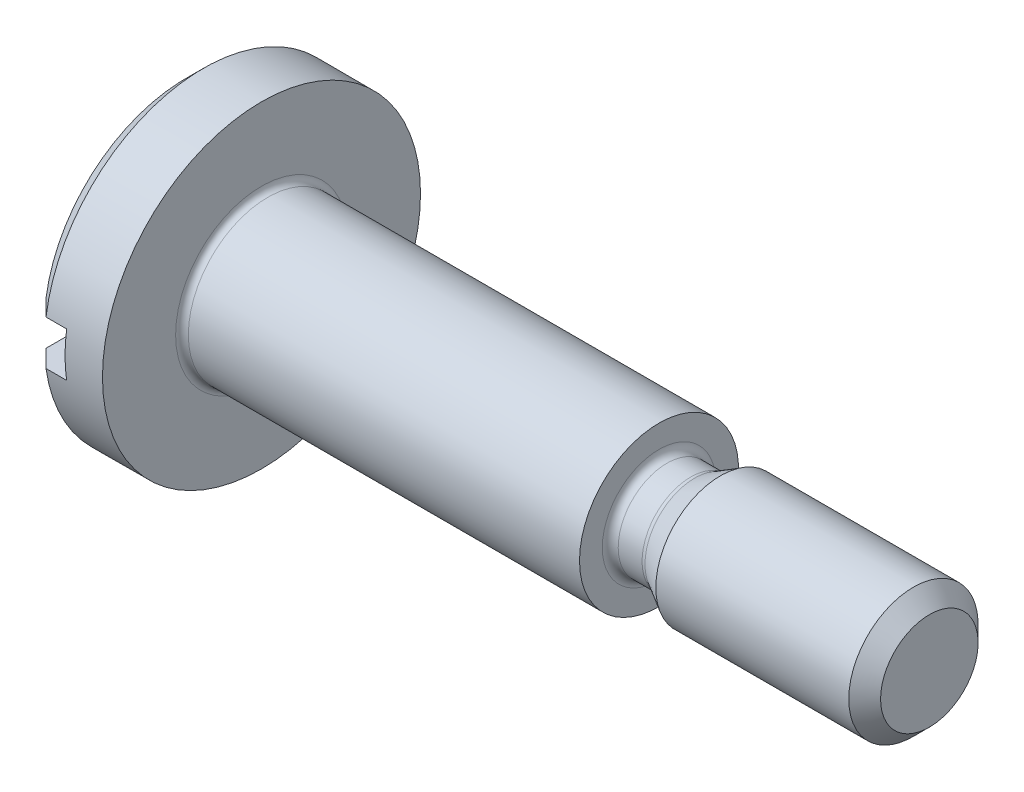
ISO-10303-21;
HEADER;
FILE_DESCRIPTION(('STEP AP214'),'2;1');
FILE_NAME('part.step','',(''),(''),'','','');
FILE_SCHEMA(('AUTOMOTIVE_DESIGN { 1 0 10303 214 1 1 1 1 }'));
ENDSEC;
DATA;
#1=APPLICATION_CONTEXT('core data for automotive mechanical design processes');
#2=APPLICATION_PROTOCOL_DEFINITION('international standard','automotive_design',2000,#1);
#3=PRODUCT_CONTEXT('',#1,'mechanical');
#4=PRODUCT('Part','Part','',(#3));
#5=PRODUCT_RELATED_PRODUCT_CATEGORY('part','',(#4));
#6=PRODUCT_DEFINITION_FORMATION('','',#4);
#7=PRODUCT_DEFINITION_CONTEXT('part definition',#1,'design');
#8=PRODUCT_DEFINITION('design','',#6,#7);
#9=PRODUCT_DEFINITION_SHAPE('','',#8);
#10=(LENGTH_UNIT() NAMED_UNIT(*) SI_UNIT(.MILLI.,.METRE.));
#11=(NAMED_UNIT(*) PLANE_ANGLE_UNIT() SI_UNIT($,.RADIAN.));
#12=(NAMED_UNIT(*) SI_UNIT($,.STERADIAN.) SOLID_ANGLE_UNIT());
#13=UNCERTAINTY_MEASURE_WITH_UNIT(LENGTH_MEASURE(1.E-05),#10,'distance_accuracy_value','');
#14=(GEOMETRIC_REPRESENTATION_CONTEXT(3) GLOBAL_UNCERTAINTY_ASSIGNED_CONTEXT((#13)) GLOBAL_UNIT_ASSIGNED_CONTEXT((#10,
#11,#12)) REPRESENTATION_CONTEXT('',''));
#15=CARTESIAN_POINT('',(0.,0.,0.));
#16=DIRECTION('',(0.,0.,1.));
#17=DIRECTION('',(1.,0.,0.));
#18=AXIS2_PLACEMENT_3D('',#15,#16,#17);
#19=CARTESIAN_POINT('',(0.,0.,0.));
#20=DIRECTION('',(-1.,0.,0.));
#21=DIRECTION('',(0.,0.,1.));
#22=AXIS2_PLACEMENT_3D('',#19,#20,#21);
#23=PLANE('',#22);
#24=DIRECTION('',(0.,0.,-1.));
#25=VECTOR('',#24,1.);
#26=CARTESIAN_POINT('',(0.,1.4,10.));
#27=LINE('',#26,#25);
#28=CARTESIAN_POINT('',(0.,1.4,8.78919791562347));
#29=VERTEX_POINT('',#28);
#30=CARTESIAN_POINT('',(0.,1.4,-8.78919791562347));
#31=VERTEX_POINT('',#30);
#32=EDGE_CURVE('E201',#29,#31,#27,.T.);
#33=ORIENTED_EDGE('',*,*,#32,.F.);
#34=CARTESIAN_POINT('',(0.,0.,0.));
#35=DIRECTION('',(-1.,0.,0.));
#36=DIRECTION('',(0.,0.,1.));
#37=AXIS2_PLACEMENT_3D('',#34,#35,#36);
#38=CIRCLE('',#37,8.9);
#39=EDGE_CURVE('E131',#29,#31,#38,.T.);
#40=ORIENTED_EDGE('',*,*,#39,.T.);
#41=EDGE_LOOP('',(#33,#40));
#42=FACE_BOUND('',#41,.T.);
#43=ADVANCED_FACE('F33',(#42),#23,.T.);
#44=CARTESIAN_POINT('',(1.1,0.,0.));
#45=DIRECTION('',(1.,0.,0.));
#46=DIRECTION('',(0.,0.,-1.));
#47=AXIS2_PLACEMENT_3D('',#44,#45,#46);
#48=CONICAL_SURFACE('',#47,10.,0.785398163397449);
#49=CARTESIAN_POINT('',(1.1,0.,0.));
#50=DIRECTION('',(-1.,0.,0.));
#51=DIRECTION('',(0.,0.,1.));
#52=AXIS2_PLACEMENT_3D('',#49,#50,#51);
#53=CIRCLE('',#52,10.);
#54=CARTESIAN_POINT('',(1.1,1.4,9.90151503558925));
#55=VERTEX_POINT('',#54);
#56=CARTESIAN_POINT('',(1.1,1.4,-9.90151503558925));
#57=VERTEX_POINT('',#56);
#58=EDGE_CURVE('E105',#55,#57,#53,.T.);
#59=ORIENTED_EDGE('',*,*,#58,.T.);
#60=CARTESIAN_POINT('',(13.1183362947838,1.4,-21.9737828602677));
#61=CARTESIAN_POINT('',(12.3669059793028,1.4,-21.2208171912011));
#62=CARTESIAN_POINT('',(11.615542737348,1.4,-20.4677845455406));
#63=CARTESIAN_POINT('',(10.1130222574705,1.4,-18.9614869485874));
#64=CARTESIAN_POINT('',(9.36186502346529,1.4,-18.2082219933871));
#65=CARTESIAN_POINT('',(7.85955437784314,1.4,-16.7010864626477));
#66=CARTESIAN_POINT('',(7.10840108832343,1.4,-15.9472157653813));
#67=CARTESIAN_POINT('',(5.60657238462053,1.4,-14.4390246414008));
#68=CARTESIAN_POINT('',(4.85589696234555,1.4,-13.6847042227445));
#69=CARTESIAN_POINT('',(3.33999593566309,1.4,-12.1599559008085));
#70=CARTESIAN_POINT('',(2.57478547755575,1.4,-11.389512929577));
#71=CARTESIAN_POINT('',(1.42799608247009,1.4,-10.2327894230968));
#72=CARTESIAN_POINT('',(1.04589366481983,1.4,-9.84702795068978));
#73=CARTESIAN_POINT('',(0.282190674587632,1.4,-9.07501238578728));
#74=CARTESIAN_POINT('',(-0.0994099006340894,1.4,-8.6887582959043));
#75=CARTESIAN_POINT('',(-0.861781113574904,1.4,-7.91562329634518));
#76=CARTESIAN_POINT('',(-1.24255193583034,1.4,-7.52874256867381));
#77=CARTESIAN_POINT('',(-2.0029710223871,1.4,-6.75386230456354));
#78=CARTESIAN_POINT('',(-2.38261926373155,1.4,-6.36586274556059));
#79=CARTESIAN_POINT('',(-2.95062619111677,1.4,-5.78247134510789));
#80=CARTESIAN_POINT('',(-3.13970884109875,1.4,-5.58778461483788));
#81=CARTESIAN_POINT('',(-3.51721231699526,1.4,-5.19777082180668));
#82=CARTESIAN_POINT('',(-3.70563314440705,1.4,-5.00244376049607));
#83=CARTESIAN_POINT('',(-4.08154641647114,1.4,-4.61091013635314));
#84=CARTESIAN_POINT('',(-4.26903889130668,1.4,-4.41470360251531));
#85=CARTESIAN_POINT('',(-4.64268522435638,1.4,-4.02102091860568));
#86=CARTESIAN_POINT('',(-4.82883909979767,1.4,-3.82354478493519));
#87=CARTESIAN_POINT('',(-5.06399679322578,1.4,-3.57145430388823));
#88=CARTESIAN_POINT('',(-5.1139632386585,1.4,-3.5177378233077));
#89=CARTESIAN_POINT('',(-5.21372029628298,1.4,-3.41014160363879));
#90=CARTESIAN_POINT('',(-5.2635109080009,1.4,-3.35626186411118));
#91=CARTESIAN_POINT('',(-5.41258534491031,1.4,-3.19434530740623));
#92=CARTESIAN_POINT('',(-5.51157032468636,1.4,-3.08603270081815));
#93=CARTESIAN_POINT('',(-5.70833720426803,1.4,-2.86859717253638));
#94=CARTESIAN_POINT('',(-5.80612060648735,1.4,-2.75947561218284));
#95=CARTESIAN_POINT('',(-6.00022872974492,1.4,-2.53994400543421));
#96=CARTESIAN_POINT('',(-6.09655349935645,1.4,-2.42953400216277));
#97=CARTESIAN_POINT('',(-6.25772763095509,1.4,-2.24124497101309));
#98=CARTESIAN_POINT('',(-6.32312294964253,1.4,-2.16383398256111));
#99=CARTESIAN_POINT('',(-6.45258851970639,1.4,-2.00791328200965));
#100=CARTESIAN_POINT('',(-6.51665882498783,1.4,-1.92940361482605));
#101=CARTESIAN_POINT('',(-6.64318992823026,1.4,-1.77073200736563));
#102=CARTESIAN_POINT('',(-6.70564571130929,1.4,-1.69056605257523));
#103=CARTESIAN_POINT('',(-6.82804619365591,1.4,-1.52834444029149));
#104=CARTESIAN_POINT('',(-6.88799131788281,1.4,-1.44628910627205));
#105=CARTESIAN_POINT('',(-6.99219748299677,1.4,-1.29689813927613));
#106=CARTESIAN_POINT('',(-7.03713410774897,1.4,-1.23003664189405));
#107=CARTESIAN_POINT('',(-7.12387095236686,1.4,-1.09424479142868));
#108=CARTESIAN_POINT('',(-7.16566966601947,1.4,-1.02531346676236));
#109=CARTESIAN_POINT('',(-7.24466911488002,1.4,-0.885132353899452));
#110=CARTESIAN_POINT('',(-7.28188516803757,1.4,-0.81389135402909));
#111=CARTESIAN_POINT('',(-7.34992716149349,1.4,-0.66847604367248));
#112=CARTESIAN_POINT('',(-7.38076069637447,1.4,-0.594305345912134));
#113=CARTESIAN_POINT('',(-7.4360682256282,1.4,-0.434942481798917));
#114=CARTESIAN_POINT('',(-7.45958136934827,1.4,-0.349395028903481));
#115=CARTESIAN_POINT('',(-7.48359397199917,1.4,-0.219161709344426));
#116=CARTESIAN_POINT('',(-7.48972123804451,1.4,-0.175494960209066));
#117=CARTESIAN_POINT('',(-7.49792914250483,1.4,-0.0877736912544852));
#118=CARTESIAN_POINT('',(-7.50001007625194,1.4,-0.0437191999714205));
#119=CARTESIAN_POINT('',(-7.49998980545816,1.4,0.044555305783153));
#120=CARTESIAN_POINT('',(-7.4978726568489,1.4,0.0887753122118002));
#121=CARTESIAN_POINT('',(-7.48955832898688,1.4,0.176826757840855));
#122=CARTESIAN_POINT('',(-7.48336082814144,1.4,0.220658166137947));
#123=CARTESIAN_POINT('',(-7.46721522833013,1.4,0.307751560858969));
#124=CARTESIAN_POINT('',(-7.45725583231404,1.4,0.351011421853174));
#125=CARTESIAN_POINT('',(-7.43406971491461,1.4,0.436635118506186));
#126=CARTESIAN_POINT('',(-7.42084273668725,1.4,0.478998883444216));
#127=CARTESIAN_POINT('',(-7.37441083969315,1.4,0.612176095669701));
#128=CARTESIAN_POINT('',(-7.33604567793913,1.4,0.701188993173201));
#129=CARTESIAN_POINT('',(-7.250778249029,1.4,0.875040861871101));
#130=CARTESIAN_POINT('',(-7.20385901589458,1.4,0.959871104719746));
#131=CARTESIAN_POINT('',(-7.10409140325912,1.4,1.12685129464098));
#132=CARTESIAN_POINT('',(-7.05119863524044,1.4,1.20897440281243));
#133=CARTESIAN_POINT('',(-6.96906786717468,1.4,1.33017698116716));
#134=CARTESIAN_POINT('',(-6.94123866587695,1.4,1.37023012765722));
#135=CARTESIAN_POINT('',(-6.88479169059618,1.4,1.44977602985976));
#136=CARTESIAN_POINT('',(-6.85617394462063,1.4,1.48926880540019));
#137=CARTESIAN_POINT('',(-6.76355741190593,1.4,1.61486926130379));
#138=CARTESIAN_POINT('',(-6.69830597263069,1.4,1.70005240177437));
#139=CARTESIAN_POINT('',(-6.56561520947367,1.4,1.86870242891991));
#140=CARTESIAN_POINT('',(-6.4981755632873,1.4,1.95216905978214));
#141=CARTESIAN_POINT('',(-6.36168848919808,1.4,2.11783624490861));
#142=CARTESIAN_POINT('',(-6.2926403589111,1.4,2.20003621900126));
#143=CARTESIAN_POINT('',(-6.15336552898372,1.4,2.36343317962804));
#144=CARTESIAN_POINT('',(-6.08313878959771,1.4,2.44463013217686));
#145=CARTESIAN_POINT('',(-5.87089373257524,1.4,2.68732215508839));
#146=CARTESIAN_POINT('',(-5.72753813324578,1.4,2.8476463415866));
#147=CARTESIAN_POINT('',(-5.43868072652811,1.4,3.16625856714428));
#148=CARTESIAN_POINT('',(-5.29317950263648,1.4,3.3245471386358));
#149=CARTESIAN_POINT('',(-5.00125032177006,1.4,3.63918632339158));
#150=CARTESIAN_POINT('',(-4.85482772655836,1.4,3.79554191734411));
#151=CARTESIAN_POINT('',(-4.56095961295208,1.4,4.10730705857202));
#152=CARTESIAN_POINT('',(-4.41351402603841,1.4,4.26271654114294));
#153=CARTESIAN_POINT('',(-4.11803370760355,1.4,4.57267860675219));
#154=CARTESIAN_POINT('',(-3.96999970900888,1.4,4.72723188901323));
#155=CARTESIAN_POINT('',(-3.67338319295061,1.4,5.03580405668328));
#156=CARTESIAN_POINT('',(-3.52480068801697,1.4,5.18982295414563));
#157=CARTESIAN_POINT('',(-3.07952815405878,1.4,5.65013099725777));
#158=CARTESIAN_POINT('',(-2.78221594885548,1.4,5.95581810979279));
#159=CARTESIAN_POINT('',(-2.18655444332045,1.4,6.56618066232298));
#160=CARTESIAN_POINT('',(-1.88820513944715,1.4,6.87085609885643));
#161=CARTESIAN_POINT('',(-1.29080174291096,1.4,7.47952507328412));
#162=CARTESIAN_POINT('',(-0.991747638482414,1.4,7.78351859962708));
#163=CARTESIAN_POINT('',(-0.393146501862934,1.4,8.39102004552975));
#164=CARTESIAN_POINT('',(-0.0935994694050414,1.4,8.69452796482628));
#165=CARTESIAN_POINT('',(0.80580526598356,1.4,9.60476284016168));
#166=CARTESIAN_POINT('',(1.40619429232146,1.4,10.2109647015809));
#167=CARTESIAN_POINT('',(2.60777785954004,1.4,11.4225597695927));
#168=CARTESIAN_POINT('',(3.20897239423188,1.4,12.0279529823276));
#169=CARTESIAN_POINT('',(4.41204591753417,1.4,13.2383916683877));
#170=CARTESIAN_POINT('',(5.01392504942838,1.4,13.8434369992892));
#171=CARTESIAN_POINT('',(6.21803298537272,1.4,15.0531819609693));
#172=CARTESIAN_POINT('',(6.82026179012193,1.4,15.657881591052));
#173=CARTESIAN_POINT('',(8.62719765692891,1.4,17.4715069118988));
#174=CARTESIAN_POINT('',(9.83226659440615,1.4,18.6800720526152));
#175=CARTESIAN_POINT('',(11.2109766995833,1.4,20.0621913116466));
#176=CARTESIAN_POINT('',(11.3843650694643,1.4,20.2359977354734));
#177=CARTESIAN_POINT('',(11.7311541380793,1.4,20.5836018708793));
#178=CARTESIAN_POINT('',(11.9045548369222,1.4,20.7573995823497));
#179=CARTESIAN_POINT('',(12.2513480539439,1.4,21.1049676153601));
#180=CARTESIAN_POINT('',(12.4247405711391,1.4,21.2787379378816));
#181=CARTESIAN_POINT('',(12.7715327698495,1.4,21.6262678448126));
#182=CARTESIAN_POINT('',(12.944932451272,1.4,21.8000274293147));
#183=CARTESIAN_POINT('',(13.1183362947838,1.4,21.9737828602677));
#184=B_SPLINE_CURVE_WITH_KNOTS('',3,(#60,#61,#62,#63,#64,#65,#66,#67,#68,#69,#70,#71,#72,#73,
#74,#75,#76,#77,#78,#79,#80,#81,#82,#83,#84,#85,#86,#87,#88,#89,#90,#91,#92,#93,#94,#95,#96,#97,
#98,#99,#100,#101,#102,#103,#104,#105,#106,#107,#108,#109,#110,#111,#112,#113,#114,#115,#116,
#117,#118,#119,#120,#121,#122,#123,#124,#125,#126,#127,#128,#129,#130,#131,#132,#133,#134,#135,
#136,#137,#138,#139,#140,#141,#142,#143,#144,#145,#146,#147,#148,#149,#150,#151,#152,#153,#154,
#155,#156,#157,#158,#159,#160,#161,#162,#163,#164,#165,#166,#167,#168,#169,#170,#171,#172,#173,
#174,#175,#176,#177,#178,#179,#180,#181,#182,#183),.UNSPECIFIED.,.F.,.F.,(4,2,2,2,2,2,2,2,2,2,2,
2,2,2,2,2,2,2,2,2,2,2,2,2,2,2,2,2,2,2,2,2,2,2,2,2,2,2,2,2,2,2,2,2,2,2,2,2,2,2,2,2,2,2,2,2,2,2,2,
2,2,4),(0.,3.19130750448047,6.38267198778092,9.57531503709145,12.767902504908,16.0255330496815,
17.6544365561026,19.2833314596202,20.9118168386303,22.5403352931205,23.3545188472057,
24.1687005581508,24.9828556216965,25.7970001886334,26.0170883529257,26.2371771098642,
26.6773609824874,27.1169228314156,27.5564700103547,27.8604678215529,28.1644532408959,
28.4692907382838,28.7740764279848,29.0156904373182,29.257419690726,29.4983176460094,
29.738927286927,30.0039149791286,30.1360359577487,30.2681472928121,30.4007613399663,
30.5333858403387,30.6664118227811,30.7994482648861,31.0894260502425,31.3799853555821,
31.672866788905,31.8191774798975,31.9654829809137,32.2873332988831,32.6092312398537,
32.9312724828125,33.2533246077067,33.8984925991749,34.5434882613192,35.1861164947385,
35.8287881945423,36.4708198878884,37.1128370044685,38.3921103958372,39.6713881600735,
40.9506874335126,42.2299874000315,44.7895812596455,47.3491555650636,49.9094375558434,
52.4697246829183,57.5898207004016,58.3263326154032,59.0628521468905,59.7992961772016,
60.5357325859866),.UNSPECIFIED.);
#185=EDGE_CURVE('E47',#57,#31,#184,.T.);
#186=ORIENTED_EDGE('',*,*,#185,.T.);
#187=ORIENTED_EDGE('',*,*,#39,.F.);
#188=EDGE_CURVE('E209',#29,#55,#184,.T.);
#189=ORIENTED_EDGE('',*,*,#188,.T.);
#190=EDGE_LOOP('',(#59,#186,#187,#189));
#191=FACE_BOUND('',#190,.T.);
#192=ADVANCED_FACE('F183',(#191),#48,.T.);
#193=CARTESIAN_POINT('',(-25.4,0.,0.));
#194=DIRECTION('',(-1.,0.,0.));
#195=DIRECTION('',(0.,0.,1.));
#196=AXIS2_PLACEMENT_3D('',#193,#194,#195);
#197=CYLINDRICAL_SURFACE('',#196,5.);
#198=CARTESIAN_POINT('',(5.15,0.,0.));
#199=DIRECTION('',(-1.,0.,0.));
#200=DIRECTION('',(0.,0.,1.));
#201=AXIS2_PLACEMENT_3D('',#198,#199,#200);
#202=CIRCLE('',#201,5.);
#203=CARTESIAN_POINT('',(5.15,0.,5.));
#204=VERTEX_POINT('',#203);
#205=EDGE_CURVE('E95',#204,#204,#202,.F.);
#206=ORIENTED_EDGE('',*,*,#205,.T.);
#207=EDGE_LOOP('',(#206));
#208=FACE_BOUND('',#207,.T.);
#209=CARTESIAN_POINT('',(29.75,0.,0.));
#210=DIRECTION('',(-1.,0.,0.));
#211=DIRECTION('',(0.,0.,1.));
#212=AXIS2_PLACEMENT_3D('',#209,#210,#211);
#213=CIRCLE('',#212,5.);
#214=CARTESIAN_POINT('',(29.75,0.,5.));
#215=VERTEX_POINT('',#214);
#216=EDGE_CURVE('E155',#215,#215,#213,.T.);
#217=ORIENTED_EDGE('',*,*,#216,.T.);
#218=EDGE_LOOP('',(#217));
#219=FACE_BOUND('',#218,.T.);
#220=ADVANCED_FACE('F164',(#208,#219),#197,.T.);
#221=CARTESIAN_POINT('',(29.75,5.,0.));
#222=DIRECTION('',(1.,0.,0.));
#223=DIRECTION('',(0.,0.,-1.));
#224=AXIS2_PLACEMENT_3D('',#221,#222,#223);
#225=PLANE('',#224);
#226=CARTESIAN_POINT('',(29.75,0.,0.));
#227=DIRECTION('',(-1.,0.,0.));
#228=DIRECTION('',(0.,0.,1.));
#229=AXIS2_PLACEMENT_3D('',#226,#227,#228);
#230=CIRCLE('',#229,3.56626694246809);
#231=CARTESIAN_POINT('',(29.75,0.,3.56626694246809));
#232=VERTEX_POINT('',#231);
#233=EDGE_CURVE('E152',#232,#232,#230,.T.);
#234=ORIENTED_EDGE('',*,*,#233,.T.);
#235=EDGE_LOOP('',(#234));
#236=FACE_BOUND('',#235,.T.);
#237=ORIENTED_EDGE('',*,*,#216,.F.);
#238=EDGE_LOOP('',(#237));
#239=FACE_BOUND('',#238,.T.);
#240=ADVANCED_FACE('F329',(#236,#239),#225,.T.);
#241=CARTESIAN_POINT('',(30.25,0.,0.));
#242=DIRECTION('',(-1.,0.,0.));
#243=DIRECTION('',(0.,0.,1.));
#244=AXIS2_PLACEMENT_3D('',#241,#242,#243);
#245=TOROIDAL_SURFACE('',#244,3.56626694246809,0.5);
#246=ORIENTED_EDGE('',*,*,#233,.F.);
#247=EDGE_LOOP('',(#246));
#248=FACE_BOUND('',#247,.T.);
#249=CARTESIAN_POINT('',(30.25,0.,0.));
#250=DIRECTION('',(-1.,0.,0.));
#251=DIRECTION('',(0.,0.,1.));
#252=AXIS2_PLACEMENT_3D('',#249,#250,#251);
#253=CIRCLE('',#252,3.06626694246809);
#254=CARTESIAN_POINT('',(30.25,0.,3.06626694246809));
#255=VERTEX_POINT('',#254);
#256=EDGE_CURVE('E149',#255,#255,#253,.T.);
#257=ORIENTED_EDGE('',*,*,#256,.T.);
#258=EDGE_LOOP('',(#257));
#259=FACE_BOUND('',#258,.T.);
#260=ADVANCED_FACE('F320',(#248,#259),#245,.F.);
#261=CARTESIAN_POINT('',(-25.4,0.,0.));
#262=DIRECTION('',(-1.,0.,0.));
#263=DIRECTION('',(0.,0.,1.));
#264=AXIS2_PLACEMENT_3D('',#261,#262,#263);
#265=CYLINDRICAL_SURFACE('',#264,3.06626694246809);
#266=CARTESIAN_POINT('',(31.75,0.,0.));
#267=DIRECTION('',(-1.,0.,0.));
#268=DIRECTION('',(0.,0.,1.));
#269=AXIS2_PLACEMENT_3D('',#266,#267,#268);
#270=CIRCLE('',#269,3.06626694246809);
#271=CARTESIAN_POINT('',(31.75,0.,3.06626694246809));
#272=VERTEX_POINT('',#271);
#273=EDGE_CURVE('E146',#272,#272,#270,.T.);
#274=ORIENTED_EDGE('',*,*,#273,.T.);
#275=EDGE_LOOP('',(#274));
#276=FACE_BOUND('',#275,.T.);
#277=ORIENTED_EDGE('',*,*,#256,.F.);
#278=EDGE_LOOP('',(#277));
#279=FACE_BOUND('',#278,.T.);
#280=ADVANCED_FACE('F311',(#276,#279),#265,.T.);
#281=CARTESIAN_POINT('',(31.75,0.,0.));
#282=DIRECTION('',(-1.,0.,0.));
#283=DIRECTION('',(0.,0.,1.));
#284=AXIS2_PLACEMENT_3D('',#281,#282,#283);
#285=TOROIDAL_SURFACE('',#284,3.56626694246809,0.500000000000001);
#286=ORIENTED_EDGE('',*,*,#273,.F.);
#287=EDGE_LOOP('',(#286));
#288=FACE_BOUND('',#287,.T.);
#289=CARTESIAN_POINT('',(32.,0.,0.));
#290=DIRECTION('',(-1.,0.,0.));
#291=DIRECTION('',(0.,0.,1.));
#292=AXIS2_PLACEMENT_3D('',#289,#290,#291);
#293=CIRCLE('',#292,3.13325424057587);
#294=CARTESIAN_POINT('',(32.,0.,3.13325424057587));
#295=VERTEX_POINT('',#294);
#296=EDGE_CURVE('E143',#295,#295,#293,.T.);
#297=ORIENTED_EDGE('',*,*,#296,.T.);
#298=EDGE_LOOP('',(#297));
#299=FACE_BOUND('',#298,.T.);
#300=ADVANCED_FACE('F302',(#288,#299),#285,.F.);
#301=CARTESIAN_POINT('',(32.,0.,0.));
#302=DIRECTION('',(1.,0.,0.));
#303=DIRECTION('',(0.,0.,-1.));
#304=AXIS2_PLACEMENT_3D('',#301,#302,#303);
#305=CONICAL_SURFACE('',#304,3.13325424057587,0.523598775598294);
#306=CARTESIAN_POINT('',(33.6160254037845,0.,0.));
#307=DIRECTION('',(-1.,0.,0.));
#308=DIRECTION('',(0.,0.,1.));
#309=AXIS2_PLACEMENT_3D('',#306,#307,#308);
#310=CIRCLE('',#309,4.06626694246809);
#311=CARTESIAN_POINT('',(33.6160254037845,0.,4.06626694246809));
#312=VERTEX_POINT('',#311);
#313=EDGE_CURVE('E140',#312,#312,#310,.T.);
#314=ORIENTED_EDGE('',*,*,#313,.T.);
#315=EDGE_LOOP('',(#314));
#316=FACE_BOUND('',#315,.T.);
#317=ORIENTED_EDGE('',*,*,#296,.F.);
#318=EDGE_LOOP('',(#317));
#319=FACE_BOUND('',#318,.T.);
#320=ADVANCED_FACE('F293',(#316,#319),#305,.T.);
#321=CARTESIAN_POINT('',(-25.4,0.,0.));
#322=DIRECTION('',(-1.,0.,0.));
#323=DIRECTION('',(0.,0.,1.));
#324=AXIS2_PLACEMENT_3D('',#321,#322,#323);
#325=CYLINDRICAL_SURFACE('',#324,4.06626694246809);
#326=ORIENTED_EDGE('',*,*,#313,.F.);
#327=EDGE_LOOP('',(#326));
#328=FACE_BOUND('',#327,.T.);
#329=CARTESIAN_POINT('',(45.75,0.,0.));
#330=DIRECTION('',(-1.,0.,0.));
#331=DIRECTION('',(0.,0.,1.));
#332=AXIS2_PLACEMENT_3D('',#329,#330,#331);
#333=CIRCLE('',#332,4.06626694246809);
#334=CARTESIAN_POINT('',(45.75,0.,4.06626694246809));
#335=VERTEX_POINT('',#334);
#336=EDGE_CURVE('E137',#335,#335,#333,.T.);
#337=ORIENTED_EDGE('',*,*,#336,.T.);
#338=EDGE_LOOP('',(#337));
#339=FACE_BOUND('',#338,.T.);
#340=ADVANCED_FACE('F284',(#328,#339),#325,.T.);
#341=CARTESIAN_POINT('',(46.75,0.,0.));
#342=DIRECTION('',(-1.,0.,0.));
#343=DIRECTION('',(0.,0.,1.));
#344=AXIS2_PLACEMENT_3D('',#341,#342,#343);
#345=CONICAL_SURFACE('',#344,3.06626694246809,0.785398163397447);
#346=ORIENTED_EDGE('',*,*,#336,.F.);
#347=EDGE_LOOP('',(#346));
#348=FACE_BOUND('',#347,.T.);
#349=CARTESIAN_POINT('',(46.75,0.,0.));
#350=DIRECTION('',(-1.,0.,0.));
#351=DIRECTION('',(0.,0.,1.));
#352=AXIS2_PLACEMENT_3D('',#349,#350,#351);
#353=CIRCLE('',#352,3.06626694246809);
#354=CARTESIAN_POINT('',(46.75,0.,3.06626694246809));
#355=VERTEX_POINT('',#354);
#356=EDGE_CURVE('E134',#355,#355,#353,.T.);
#357=ORIENTED_EDGE('',*,*,#356,.T.);
#358=EDGE_LOOP('',(#357));
#359=FACE_BOUND('',#358,.T.);
#360=ADVANCED_FACE('F199',(#348,#359),#345,.T.);
#361=CARTESIAN_POINT('',(46.75,3.06626694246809,0.));
#362=DIRECTION('',(1.,0.,0.));
#363=DIRECTION('',(0.,0.,-1.));
#364=AXIS2_PLACEMENT_3D('',#361,#362,#363);
#365=PLANE('',#364);
#366=ORIENTED_EDGE('',*,*,#356,.F.);
#367=EDGE_LOOP('',(#366));
#368=FACE_BOUND('',#367,.T.);
#369=ADVANCED_FACE('F194',(#368),#365,.T.);
#370=DIRECTION('',(0.,0.,1.));
#371=VECTOR('',#370,1.);
#372=CARTESIAN_POINT('',(0.,-1.4,-10.));
#373=LINE('',#372,#371);
#374=CARTESIAN_POINT('',(0.,-1.4,-8.78919791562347));
#375=VERTEX_POINT('',#374);
#376=CARTESIAN_POINT('',(0.,-1.4,8.78919791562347));
#377=VERTEX_POINT('',#376);
#378=EDGE_CURVE('E99',#375,#377,#373,.T.);
#379=ORIENTED_EDGE('',*,*,#378,.F.);
#380=EDGE_CURVE('E122',#375,#377,#38,.T.);
#381=ORIENTED_EDGE('',*,*,#380,.T.);
#382=EDGE_LOOP('',(#379,#381));
#383=FACE_BOUND('',#382,.T.);
#384=ADVANCED_FACE('F181',(#383),#23,.T.);
#385=CARTESIAN_POINT('',(1.1,-1.4,-9.90151503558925));
#386=VERTEX_POINT('',#385);
#387=CARTESIAN_POINT('',(1.1,-1.4,9.90151503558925));
#388=VERTEX_POINT('',#387);
#389=EDGE_CURVE('E120',#386,#388,#53,.T.);
#390=ORIENTED_EDGE('',*,*,#389,.T.);
#391=CARTESIAN_POINT('',(13.1183362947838,-1.4,21.9737828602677));
#392=CARTESIAN_POINT('',(12.3669059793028,-1.4,21.2208171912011));
#393=CARTESIAN_POINT('',(11.615542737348,-1.4,20.4677845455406));
#394=CARTESIAN_POINT('',(10.1130222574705,-1.4,18.9614869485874));
#395=CARTESIAN_POINT('',(9.36186502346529,-1.4,18.2082219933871));
#396=CARTESIAN_POINT('',(7.85955437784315,-1.4,16.7010864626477));
#397=CARTESIAN_POINT('',(7.10840108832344,-1.4,15.9472157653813));
#398=CARTESIAN_POINT('',(5.60657238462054,-1.4,14.4390246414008));
#399=CARTESIAN_POINT('',(4.85589696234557,-1.4,13.6847042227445));
#400=CARTESIAN_POINT('',(3.33999593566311,-1.4,12.1599559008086));
#401=CARTESIAN_POINT('',(2.57478547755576,-1.4,11.389512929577));
#402=CARTESIAN_POINT('',(1.42799608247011,-1.4,10.2327894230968));
#403=CARTESIAN_POINT('',(1.04589366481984,-1.4,9.8470279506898));
#404=CARTESIAN_POINT('',(0.28219067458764,-1.4,9.07501238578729));
#405=CARTESIAN_POINT('',(-0.0994099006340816,-1.4,8.68875829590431));
#406=CARTESIAN_POINT('',(-0.861781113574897,-1.4,7.91562329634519));
#407=CARTESIAN_POINT('',(-1.24255193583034,-1.4,7.52874256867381));
#408=CARTESIAN_POINT('',(-2.0029710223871,-1.4,6.75386230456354));
#409=CARTESIAN_POINT('',(-2.38261926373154,-1.4,6.36586274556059));
#410=CARTESIAN_POINT('',(-2.95062619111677,-1.4,5.78247134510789));
#411=CARTESIAN_POINT('',(-3.13970884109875,-1.4,5.58778461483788));
#412=CARTESIAN_POINT('',(-3.51721231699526,-1.4,5.19777082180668));
#413=CARTESIAN_POINT('',(-3.70563314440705,-1.4,5.00244376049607));
#414=CARTESIAN_POINT('',(-4.08154641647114,-1.4,4.61091013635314));
#415=CARTESIAN_POINT('',(-4.26903889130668,-1.4,4.41470360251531));
#416=CARTESIAN_POINT('',(-4.64268522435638,-1.4,4.02102091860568));
#417=CARTESIAN_POINT('',(-4.82883909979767,-1.4,3.82354478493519));
#418=CARTESIAN_POINT('',(-5.06399679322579,-1.4,3.57145430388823));
#419=CARTESIAN_POINT('',(-5.11396323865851,-1.4,3.5177378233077));
#420=CARTESIAN_POINT('',(-5.21372029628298,-1.4,3.41014160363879));
#421=CARTESIAN_POINT('',(-5.2635109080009,-1.4,3.35626186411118));
#422=CARTESIAN_POINT('',(-5.41258534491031,-1.4,3.19434530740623));
#423=CARTESIAN_POINT('',(-5.51157032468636,-1.4,3.08603270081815));
#424=CARTESIAN_POINT('',(-5.70833720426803,-1.4,2.86859717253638));
#425=CARTESIAN_POINT('',(-5.80612060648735,-1.4,2.75947561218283));
#426=CARTESIAN_POINT('',(-6.00022872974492,-1.4,2.53994400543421));
#427=CARTESIAN_POINT('',(-6.09655349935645,-1.4,2.42953400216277));
#428=CARTESIAN_POINT('',(-6.2577276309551,-1.4,2.24124497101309));
#429=CARTESIAN_POINT('',(-6.32312294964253,-1.4,2.16383398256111));
#430=CARTESIAN_POINT('',(-6.45258851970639,-1.4,2.00791328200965));
#431=CARTESIAN_POINT('',(-6.51665882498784,-1.4,1.92940361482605));
#432=CARTESIAN_POINT('',(-6.64318992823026,-1.4,1.77073200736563));
#433=CARTESIAN_POINT('',(-6.70564571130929,-1.4,1.69056605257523));
#434=CARTESIAN_POINT('',(-6.82804619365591,-1.4,1.52834444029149));
#435=CARTESIAN_POINT('',(-6.88799131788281,-1.4,1.44628910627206));
#436=CARTESIAN_POINT('',(-6.99219748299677,-1.4,1.29689813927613));
#437=CARTESIAN_POINT('',(-7.03713410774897,-1.4,1.23003664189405));
#438=CARTESIAN_POINT('',(-7.12387095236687,-1.4,1.09424479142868));
#439=CARTESIAN_POINT('',(-7.16566966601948,-1.4,1.02531346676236));
#440=CARTESIAN_POINT('',(-7.24466911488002,-1.4,0.885132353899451));
#441=CARTESIAN_POINT('',(-7.28188516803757,-1.4,0.813891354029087));
#442=CARTESIAN_POINT('',(-7.34992716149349,-1.4,0.668476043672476));
#443=CARTESIAN_POINT('',(-7.38076069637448,-1.4,0.59430534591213));
#444=CARTESIAN_POINT('',(-7.43606822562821,-1.4,0.434942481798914));
#445=CARTESIAN_POINT('',(-7.45958136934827,-1.4,0.349395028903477));
#446=CARTESIAN_POINT('',(-7.48359397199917,-1.4,0.219161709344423));
#447=CARTESIAN_POINT('',(-7.48972123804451,-1.4,0.175494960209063));
#448=CARTESIAN_POINT('',(-7.49792914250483,-1.4,0.0877736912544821));
#449=CARTESIAN_POINT('',(-7.50001007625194,-1.4,0.0437191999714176));
#450=CARTESIAN_POINT('',(-7.49998980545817,-1.4,-0.0445553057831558));
#451=CARTESIAN_POINT('',(-7.49787265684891,-1.4,-0.088775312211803));
#452=CARTESIAN_POINT('',(-7.48955832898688,-1.4,-0.176826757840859));
#453=CARTESIAN_POINT('',(-7.48336082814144,-1.4,-0.220658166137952));
#454=CARTESIAN_POINT('',(-7.46721522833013,-1.4,-0.307751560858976));
#455=CARTESIAN_POINT('',(-7.45725583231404,-1.4,-0.35101142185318));
#456=CARTESIAN_POINT('',(-7.43406971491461,-1.4,-0.436635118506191));
#457=CARTESIAN_POINT('',(-7.42084273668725,-1.4,-0.478998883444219));
#458=CARTESIAN_POINT('',(-7.37441083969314,-1.4,-0.612176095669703));
#459=CARTESIAN_POINT('',(-7.33604567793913,-1.4,-0.701188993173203));
#460=CARTESIAN_POINT('',(-7.250778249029,-1.4,-0.875040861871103));
#461=CARTESIAN_POINT('',(-7.20385901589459,-1.4,-0.959871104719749));
#462=CARTESIAN_POINT('',(-7.10409140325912,-1.4,-1.12685129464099));
#463=CARTESIAN_POINT('',(-7.05119863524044,-1.4,-1.20897440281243));
#464=CARTESIAN_POINT('',(-6.96906786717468,-1.4,-1.33017698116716));
#465=CARTESIAN_POINT('',(-6.94123866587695,-1.4,-1.37023012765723));
#466=CARTESIAN_POINT('',(-6.88479169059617,-1.4,-1.44977602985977));
#467=CARTESIAN_POINT('',(-6.85617394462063,-1.4,-1.4892688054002));
#468=CARTESIAN_POINT('',(-6.76355741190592,-1.4,-1.6148692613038));
#469=CARTESIAN_POINT('',(-6.69830597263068,-1.4,-1.70005240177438));
#470=CARTESIAN_POINT('',(-6.56561520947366,-1.4,-1.86870242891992));
#471=CARTESIAN_POINT('',(-6.49817556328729,-1.4,-1.95216905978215));
#472=CARTESIAN_POINT('',(-6.36168848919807,-1.4,-2.11783624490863));
#473=CARTESIAN_POINT('',(-6.29264035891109,-1.4,-2.20003621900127));
#474=CARTESIAN_POINT('',(-6.15336552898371,-1.4,-2.36343317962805));
#475=CARTESIAN_POINT('',(-6.0831387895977,-1.4,-2.44463013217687));
#476=CARTESIAN_POINT('',(-5.87089373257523,-1.4,-2.68732215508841));
#477=CARTESIAN_POINT('',(-5.72753813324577,-1.4,-2.84764634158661));
#478=CARTESIAN_POINT('',(-5.4386807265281,-1.4,-3.16625856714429));
#479=CARTESIAN_POINT('',(-5.29317950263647,-1.4,-3.32454713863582));
#480=CARTESIAN_POINT('',(-5.00125032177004,-1.4,-3.6391863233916));
#481=CARTESIAN_POINT('',(-4.85482772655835,-1.4,-3.79554191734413));
#482=CARTESIAN_POINT('',(-4.56095961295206,-1.4,-4.10730705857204));
#483=CARTESIAN_POINT('',(-4.41351402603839,-1.4,-4.26271654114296));
#484=CARTESIAN_POINT('',(-4.11803370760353,-1.4,-4.57267860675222));
#485=CARTESIAN_POINT('',(-3.96999970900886,-1.4,-4.72723188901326));
#486=CARTESIAN_POINT('',(-3.67338319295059,-1.4,-5.03580405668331));
#487=CARTESIAN_POINT('',(-3.52480068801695,-1.4,-5.18982295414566));
#488=CARTESIAN_POINT('',(-3.07952815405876,-1.4,-5.65013099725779));
#489=CARTESIAN_POINT('',(-2.78221594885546,-1.4,-5.95581810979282));
#490=CARTESIAN_POINT('',(-2.18655444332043,-1.4,-6.56618066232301));
#491=CARTESIAN_POINT('',(-1.88820513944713,-1.4,-6.87085609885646));
#492=CARTESIAN_POINT('',(-1.29080174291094,-1.4,-7.47952507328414));
#493=CARTESIAN_POINT('',(-0.991747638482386,-1.4,-7.7835185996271));
#494=CARTESIAN_POINT('',(-0.393146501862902,-1.4,-8.39102004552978));
#495=CARTESIAN_POINT('',(-0.0935994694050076,-1.4,-8.69452796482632));
#496=CARTESIAN_POINT('',(0.805805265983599,-1.4,-9.60476284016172));
#497=CARTESIAN_POINT('',(1.4061942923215,-1.4,-10.210964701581));
#498=CARTESIAN_POINT('',(2.60777785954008,-1.4,-11.4225597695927));
#499=CARTESIAN_POINT('',(3.20897239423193,-1.4,-12.0279529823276));
#500=CARTESIAN_POINT('',(4.41204591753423,-1.4,-13.2383916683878));
#501=CARTESIAN_POINT('',(5.01392504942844,-1.4,-13.8434369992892));
#502=CARTESIAN_POINT('',(6.21803298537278,-1.4,-15.0531819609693));
#503=CARTESIAN_POINT('',(6.820261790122,-1.4,-15.657881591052));
#504=CARTESIAN_POINT('',(8.62719765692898,-1.4,-17.4715069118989));
#505=CARTESIAN_POINT('',(9.83226659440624,-1.4,-18.6800720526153));
#506=CARTESIAN_POINT('',(11.2109766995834,-1.4,-20.0621913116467));
#507=CARTESIAN_POINT('',(11.3843650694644,-1.4,-20.2359977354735));
#508=CARTESIAN_POINT('',(11.7311541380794,-1.4,-20.5836018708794));
#509=CARTESIAN_POINT('',(11.9045548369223,-1.4,-20.7573995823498));
#510=CARTESIAN_POINT('',(12.2513480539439,-1.4,-21.1049676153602));
#511=CARTESIAN_POINT('',(12.4247405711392,-1.4,-21.2787379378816));
#512=CARTESIAN_POINT('',(12.7715327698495,-1.4,-21.6262678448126));
#513=CARTESIAN_POINT('',(12.944932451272,-1.4,-21.8000274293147));
#514=CARTESIAN_POINT('',(13.1183362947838,-1.4,-21.9737828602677));
#515=B_SPLINE_CURVE_WITH_KNOTS('',3,(#391,#392,#393,#394,#395,#396,#397,#398,#399,#400,#401,
#402,#403,#404,#405,#406,#407,#408,#409,#410,#411,#412,#413,#414,#415,#416,#417,#418,#419,#420,
#421,#422,#423,#424,#425,#426,#427,#428,#429,#430,#431,#432,#433,#434,#435,#436,#437,#438,#439,
#440,#441,#442,#443,#444,#445,#446,#447,#448,#449,#450,#451,#452,#453,#454,#455,#456,#457,#458,
#459,#460,#461,#462,#463,#464,#465,#466,#467,#468,#469,#470,#471,#472,#473,#474,#475,#476,#477,
#478,#479,#480,#481,#482,#483,#484,#485,#486,#487,#488,#489,#490,#491,#492,#493,#494,#495,#496,
#497,#498,#499,#500,#501,#502,#503,#504,#505,#506,#507,#508,#509,#510,#511,#512,#513,#514),
.UNSPECIFIED.,.F.,.F.,(4,2,2,2,2,2,2,2,2,2,2,2,2,2,2,2,2,2,2,2,2,2,2,2,2,2,2,2,2,2,2,2,2,2,2,2,
2,2,2,2,2,2,2,2,2,2,2,2,2,2,2,2,2,2,2,2,2,2,2,2,2,4),(0.,3.19130750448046,6.38267198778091,
9.57531503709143,12.767902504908,16.0255330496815,17.6544365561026,19.2833314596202,
20.9118168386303,22.5403352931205,23.3545188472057,24.1687005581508,24.9828556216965,
25.7970001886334,26.0170883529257,26.2371771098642,26.6773609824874,27.1169228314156,
27.5564700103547,27.8604678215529,28.1644532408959,28.4692907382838,28.7740764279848,
29.0156904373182,29.257419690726,29.4983176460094,29.738927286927,30.0039149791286,
30.1360359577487,30.2681472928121,30.4007613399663,30.5333858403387,30.6664118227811,
30.7994482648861,31.0894260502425,31.3799853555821,31.672866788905,31.8191774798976,
31.9654829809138,32.2873332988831,32.6092312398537,32.9312724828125,33.2533246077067,
33.8984925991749,34.5434882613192,35.1861164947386,35.8287881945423,36.4708198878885,
37.1128370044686,38.3921103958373,39.6713881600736,40.9506874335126,42.2299874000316,
44.7895812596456,47.3491555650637,49.9094375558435,52.4697246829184,57.5898207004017,
58.3263326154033,59.0628521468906,59.7992961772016,60.5357325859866),.UNSPECIFIED.);
#516=EDGE_CURVE('E123',#388,#377,#515,.T.);
#517=ORIENTED_EDGE('',*,*,#516,.T.);
#518=ORIENTED_EDGE('',*,*,#380,.F.);
#519=EDGE_CURVE('E112',#375,#386,#515,.T.);
#520=ORIENTED_EDGE('',*,*,#519,.T.);
#521=EDGE_LOOP('',(#390,#517,#518,#520));
#522=FACE_BOUND('',#521,.T.);
#523=ADVANCED_FACE('F118',(#522),#48,.T.);
#524=CARTESIAN_POINT('',(-25.4,0.,0.));
#525=DIRECTION('',(-1.,0.,0.));
#526=DIRECTION('',(0.,0.,1.));
#527=AXIS2_PLACEMENT_3D('',#524,#525,#526);
#528=CYLINDRICAL_SURFACE('',#527,10.);
#529=DIRECTION('',(-1.,0.,0.));
#530=VECTOR('',#529,1.);
#531=CARTESIAN_POINT('',(-25.4,1.4,-9.90151503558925));
#532=LINE('',#531,#530);
#533=CARTESIAN_POINT('',(2.4,1.4,-9.90151503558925));
#534=VERTEX_POINT('',#533);
#535=EDGE_CURVE('E12',#57,#534,#532,.F.);
#536=ORIENTED_EDGE('',*,*,#535,.F.);
#537=ORIENTED_EDGE('',*,*,#58,.F.);
#538=DIRECTION('',(-1.,0.,0.));
#539=VECTOR('',#538,1.);
#540=CARTESIAN_POINT('',(-25.4,1.4,9.90151503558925));
#541=LINE('',#540,#539);
#542=CARTESIAN_POINT('',(2.4,1.4,9.90151503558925));
#543=VERTEX_POINT('',#542);
#544=EDGE_CURVE('E54',#543,#55,#541,.T.);
#545=ORIENTED_EDGE('',*,*,#544,.F.);
#546=CARTESIAN_POINT('',(2.4,0.,0.));
#547=DIRECTION('',(-1.,0.,0.));
#548=DIRECTION('',(0.,0.,1.));
#549=AXIS2_PLACEMENT_3D('',#546,#547,#548);
#550=CIRCLE('',#549,10.);
#551=CARTESIAN_POINT('',(2.4,-1.4,9.90151503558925));
#552=VERTEX_POINT('',#551);
#553=EDGE_CURVE('E85',#543,#552,#550,.F.);
#554=ORIENTED_EDGE('',*,*,#553,.T.);
#555=DIRECTION('',(-1.,0.,0.));
#556=VECTOR('',#555,1.);
#557=CARTESIAN_POINT('',(-25.4,-1.4,9.90151503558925));
#558=LINE('',#557,#556);
#559=EDGE_CURVE('E94',#388,#552,#558,.F.);
#560=ORIENTED_EDGE('',*,*,#559,.F.);
#561=ORIENTED_EDGE('',*,*,#389,.F.);
#562=DIRECTION('',(-1.,0.,0.));
#563=VECTOR('',#562,1.);
#564=CARTESIAN_POINT('',(-25.4,-1.4,-9.90151503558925));
#565=LINE('',#564,#563);
#566=CARTESIAN_POINT('',(2.4,-1.4,-9.90151503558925));
#567=VERTEX_POINT('',#566);
#568=EDGE_CURVE('E41',#567,#386,#565,.T.);
#569=ORIENTED_EDGE('',*,*,#568,.F.);
#570=EDGE_CURVE('E97',#567,#534,#550,.F.);
#571=ORIENTED_EDGE('',*,*,#570,.T.);
#572=EDGE_LOOP('',(#536,#537,#545,#554,#560,#561,#569,#571));
#573=FACE_BOUND('',#572,.T.);
#574=CARTESIAN_POINT('',(4.75,0.,0.));
#575=DIRECTION('',(-1.,0.,0.));
#576=DIRECTION('',(0.,0.,1.));
#577=AXIS2_PLACEMENT_3D('',#574,#575,#576);
#578=CIRCLE('',#577,10.);
#579=CARTESIAN_POINT('',(4.75,0.,10.));
#580=VERTEX_POINT('',#579);
#581=EDGE_CURVE('E125',#580,#580,#578,.T.);
#582=ORIENTED_EDGE('',*,*,#581,.T.);
#583=EDGE_LOOP('',(#582));
#584=FACE_BOUND('',#583,.T.);
#585=ADVANCED_FACE('F102',(#573,#584),#528,.T.);
#586=CARTESIAN_POINT('',(4.75,5.,0.));
#587=DIRECTION('',(-1.,0.,0.));
#588=DIRECTION('',(0.,0.,1.));
#589=AXIS2_PLACEMENT_3D('',#586,#587,#588);
#590=PLANE('',#589);
#591=CARTESIAN_POINT('',(4.75,0.,0.));
#592=DIRECTION('',(-1.,0.,0.));
#593=DIRECTION('',(0.,0.,1.));
#594=AXIS2_PLACEMENT_3D('',#591,#592,#593);
#595=CIRCLE('',#594,5.4);
#596=CARTESIAN_POINT('',(4.75,0.,5.4));
#597=VERTEX_POINT('',#596);
#598=EDGE_CURVE('E158',#597,#597,#595,.T.);
#599=ORIENTED_EDGE('',*,*,#598,.T.);
#600=EDGE_LOOP('',(#599));
#601=FACE_BOUND('',#600,.T.);
#602=ORIENTED_EDGE('',*,*,#581,.F.);
#603=EDGE_LOOP('',(#602));
#604=FACE_BOUND('',#603,.T.);
#605=ADVANCED_FACE('F169',(#601,#604),#590,.F.);
#606=CARTESIAN_POINT('',(5.15,0.,0.));
#607=DIRECTION('',(-1.,0.,0.));
#608=DIRECTION('',(0.,0.,1.));
#609=AXIS2_PLACEMENT_3D('',#606,#607,#608);
#610=TOROIDAL_SURFACE('',#609,5.4,0.4);
#611=ORIENTED_EDGE('',*,*,#205,.F.);
#612=EDGE_LOOP('',(#611));
#613=FACE_BOUND('',#612,.T.);
#614=ORIENTED_EDGE('',*,*,#598,.F.);
#615=EDGE_LOOP('',(#614));
#616=FACE_BOUND('',#615,.T.);
#617=ADVANCED_FACE('F35',(#613,#616),#610,.F.);
#618=CARTESIAN_POINT('',(2.4,1.4,10.));
#619=DIRECTION('',(0.,1.,0.));
#620=DIRECTION('',(0.,0.,1.));
#621=AXIS2_PLACEMENT_3D('',#618,#619,#620);
#622=PLANE('',#621);
#623=ORIENTED_EDGE('',*,*,#535,.T.);
#624=DIRECTION('',(0.,0.,-1.));
#625=VECTOR('',#624,1.);
#626=CARTESIAN_POINT('',(2.4,1.4,10.));
#627=LINE('',#626,#625);
#628=EDGE_CURVE('E87',#543,#534,#627,.T.);
#629=ORIENTED_EDGE('',*,*,#628,.F.);
#630=ORIENTED_EDGE('',*,*,#544,.T.);
#631=ORIENTED_EDGE('',*,*,#188,.F.);
#632=ORIENTED_EDGE('',*,*,#32,.T.);
#633=ORIENTED_EDGE('',*,*,#185,.F.);
#634=EDGE_LOOP('',(#623,#629,#630,#631,#632,#633));
#635=FACE_BOUND('',#634,.T.);
#636=ADVANCED_FACE('F98',(#635),#622,.F.);
#637=CARTESIAN_POINT('',(2.4,-1.4,-10.));
#638=DIRECTION('',(0.,-1.,0.));
#639=DIRECTION('',(0.,0.,-1.));
#640=AXIS2_PLACEMENT_3D('',#637,#638,#639);
#641=PLANE('',#640);
#642=ORIENTED_EDGE('',*,*,#559,.T.);
#643=DIRECTION('',(0.,0.,1.));
#644=VECTOR('',#643,1.);
#645=CARTESIAN_POINT('',(2.4,-1.4,-10.));
#646=LINE('',#645,#644);
#647=EDGE_CURVE('E90',#567,#552,#646,.T.);
#648=ORIENTED_EDGE('',*,*,#647,.F.);
#649=ORIENTED_EDGE('',*,*,#568,.T.);
#650=ORIENTED_EDGE('',*,*,#519,.F.);
#651=ORIENTED_EDGE('',*,*,#378,.T.);
#652=ORIENTED_EDGE('',*,*,#516,.F.);
#653=EDGE_LOOP('',(#642,#648,#649,#650,#651,#652));
#654=FACE_BOUND('',#653,.T.);
#655=ADVANCED_FACE('F111',(#654),#641,.F.);
#656=CARTESIAN_POINT('',(2.4,1.4,-10.));
#657=DIRECTION('',(-1.,0.,0.));
#658=DIRECTION('',(0.,0.,1.));
#659=AXIS2_PLACEMENT_3D('',#656,#657,#658);
#660=PLANE('',#659);
#661=ORIENTED_EDGE('',*,*,#647,.T.);
#662=ORIENTED_EDGE('',*,*,#553,.F.);
#663=ORIENTED_EDGE('',*,*,#628,.T.);
#664=ORIENTED_EDGE('',*,*,#570,.F.);
#665=EDGE_LOOP('',(#661,#662,#663,#664));
#666=FACE_BOUND('',#665,.T.);
#667=ADVANCED_FACE('F86',(#666),#660,.T.);
#668=CLOSED_SHELL('',(#43,#192,#220,#240,#260,#280,#300,#320,#340,#360,#369,#384,#523,#585,#605,
#617,#636,#655,#667));
#669=MANIFOLD_SOLID_BREP('B2',#668);
#670=ADVANCED_BREP_SHAPE_REPRESENTATION('',(#18,#669),#14);
#671=SHAPE_DEFINITION_REPRESENTATION(#9,#670);
ENDSEC;
END-ISO-10303-21;
